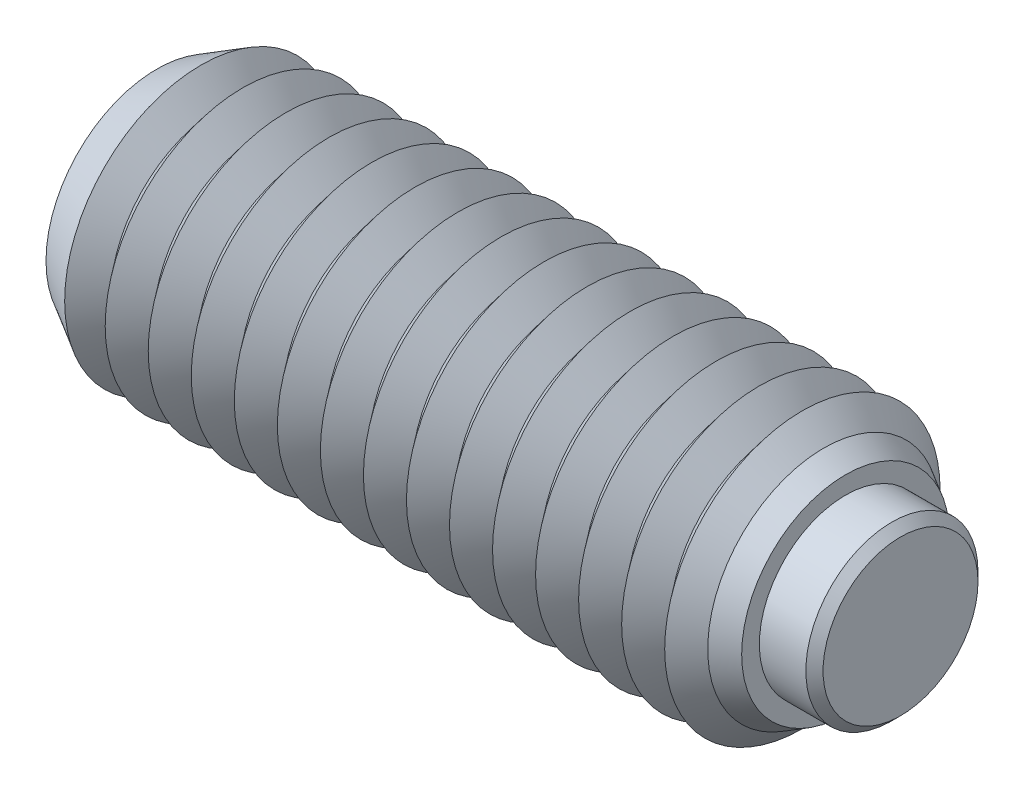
ISO-10303-21;
HEADER;
FILE_DESCRIPTION(('STEP AP214'),'2;1');
FILE_NAME('part.step','',(''),(''),'','','');
FILE_SCHEMA(('AUTOMOTIVE_DESIGN { 1 0 10303 214 1 1 1 1 }'));
ENDSEC;
DATA;
#1=APPLICATION_CONTEXT('core data for automotive mechanical design processes');
#2=APPLICATION_PROTOCOL_DEFINITION('international standard','automotive_design',2000,#1);
#3=PRODUCT_CONTEXT('',#1,'mechanical');
#4=PRODUCT('Part','Part','',(#3));
#5=PRODUCT_RELATED_PRODUCT_CATEGORY('part','',(#4));
#6=PRODUCT_DEFINITION_FORMATION('','',#4);
#7=PRODUCT_DEFINITION_CONTEXT('part definition',#1,'design');
#8=PRODUCT_DEFINITION('design','',#6,#7);
#9=PRODUCT_DEFINITION_SHAPE('','',#8);
#10=(LENGTH_UNIT() NAMED_UNIT(*) SI_UNIT(.MILLI.,.METRE.));
#11=(NAMED_UNIT(*) PLANE_ANGLE_UNIT() SI_UNIT($,.RADIAN.));
#12=(NAMED_UNIT(*) SI_UNIT($,.STERADIAN.) SOLID_ANGLE_UNIT());
#13=UNCERTAINTY_MEASURE_WITH_UNIT(LENGTH_MEASURE(1.E-05),#10,'distance_accuracy_value','');
#14=(GEOMETRIC_REPRESENTATION_CONTEXT(3) GLOBAL_UNCERTAINTY_ASSIGNED_CONTEXT((#13)) GLOBAL_UNIT_ASSIGNED_CONTEXT((#10,
#11,#12)) REPRESENTATION_CONTEXT('',''));
#15=CARTESIAN_POINT('',(0.,0.,0.));
#16=DIRECTION('',(0.,0.,1.));
#17=DIRECTION('',(1.,0.,0.));
#18=AXIS2_PLACEMENT_3D('',#15,#16,#17);
#19=CARTESIAN_POINT('',(2.225,0.,0.));
#20=DIRECTION('',(-1.,0.,0.));
#21=DIRECTION('',(0.,0.,1.));
#22=AXIS2_PLACEMENT_3D('',#19,#20,#21);
#23=CYLINDRICAL_SURFACE('',#22,2.5);
#24=CARTESIAN_POINT('',(1.975,0.,0.));
#25=DIRECTION('',(1.,0.,0.));
#26=DIRECTION('',(0.,0.,-1.));
#27=AXIS2_PLACEMENT_3D('',#24,#25,#26);
#28=CIRCLE('',#27,2.5);
#29=CARTESIAN_POINT('',(1.975,0.,-2.49999999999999));
#30=VERTEX_POINT('',#29);
#31=EDGE_CURVE('P0_E10',#30,#30,#28,.F.);
#32=ORIENTED_EDGE('',*,*,#31,.T.);
#33=EDGE_LOOP('',(#32));
#34=FACE_BOUND('',#33,.T.);
#35=CARTESIAN_POINT('',(-0.975,0.,0.));
#36=DIRECTION('',(1.,0.,0.));
#37=DIRECTION('',(0.,0.,-1.));
#38=AXIS2_PLACEMENT_3D('',#35,#36,#37);
#39=CIRCLE('',#38,2.5);
#40=CARTESIAN_POINT('',(-0.975,0.,-2.49999999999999));
#41=VERTEX_POINT('',#40);
#42=EDGE_CURVE('P0_E25',#41,#41,#39,.T.);
#43=ORIENTED_EDGE('',*,*,#42,.T.);
#44=EDGE_LOOP('',(#43));
#45=FACE_BOUND('',#44,.T.);
#46=ADVANCED_FACE('P0_F14',(#34,#45),#23,.T.);
#47=CARTESIAN_POINT('',(2.225,0.,0.));
#48=DIRECTION('',(1.,0.,0.));
#49=DIRECTION('',(0.,0.,-1.));
#50=AXIS2_PLACEMENT_3D('',#47,#48,#49);
#51=PLANE('',#50);
#52=CARTESIAN_POINT('',(2.225,0.,0.));
#53=DIRECTION('',(1.,0.,0.));
#54=DIRECTION('',(0.,0.,-1.));
#55=AXIS2_PLACEMENT_3D('',#52,#53,#54);
#56=CIRCLE('',#55,2.25);
#57=CARTESIAN_POINT('',(2.225,0.,-2.24999999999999));
#58=VERTEX_POINT('',#57);
#59=EDGE_CURVE('P0_E21',#58,#58,#56,.T.);
#60=ORIENTED_EDGE('',*,*,#59,.T.);
#61=EDGE_LOOP('',(#60));
#62=FACE_BOUND('',#61,.T.);
#63=ADVANCED_FACE('P0_F35',(#62),#51,.T.);
#64=CARTESIAN_POINT('',(-0.975,0.,0.));
#65=DIRECTION('',(1.,0.,0.));
#66=DIRECTION('',(0.,0.,-1.));
#67=AXIS2_PLACEMENT_3D('',#64,#65,#66);
#68=PLANE('',#67);
#69=ORIENTED_EDGE('',*,*,#42,.F.);
#70=EDGE_LOOP('',(#69));
#71=FACE_BOUND('',#70,.T.);
#72=ADVANCED_FACE('P0_F33',(#71),#68,.F.);
#73=CARTESIAN_POINT('',(2.225,0.,0.));
#74=DIRECTION('',(-1.,0.,0.));
#75=DIRECTION('',(0.,0.,1.));
#76=AXIS2_PLACEMENT_3D('',#73,#74,#75);
#77=CONICAL_SURFACE('',#76,2.25,0.785398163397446);
#78=ORIENTED_EDGE('',*,*,#31,.F.);
#79=EDGE_LOOP('',(#78));
#80=FACE_BOUND('',#79,.T.);
#81=ORIENTED_EDGE('',*,*,#59,.F.);
#82=EDGE_LOOP('',(#81));
#83=FACE_BOUND('',#82,.T.);
#84=ADVANCED_FACE('P0_F16',(#80,#83),#77,.T.);
#85=CLOSED_SHELL('',(#46,#63,#72,#84));
#86=MANIFOLD_SOLID_BREP('P0_B1',#85);
#87=CARTESIAN_POINT('',(-18.125,0.,0.));
#88=DIRECTION('',(-1.,0.,0.));
#89=DIRECTION('',(0.,0.,1.));
#90=AXIS2_PLACEMENT_3D('',#87,#88,#89);
#91=CONICAL_SURFACE('',#90,4.,0.895664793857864);
#92=CARTESIAN_POINT('',(-17.5,0.,0.));
#93=DIRECTION('',(1.,0.,0.));
#94=DIRECTION('',(0.,0.,-1.));
#95=AXIS2_PLACEMENT_3D('',#92,#93,#94);
#96=CIRCLE('',#95,3.2193752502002);
#97=CARTESIAN_POINT('',(-17.5,0.,-3.2193752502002));
#98=VERTEX_POINT('',#97);
#99=EDGE_CURVE('P1_E853',#98,#98,#96,.T.);
#100=ORIENTED_EDGE('',*,*,#99,.F.);
#101=EDGE_LOOP('',(#100));
#102=FACE_BOUND('',#101,.T.);
#103=CARTESIAN_POINT('',(-18.092729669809,0.,0.));
#104=DIRECTION('',(1.,0.,0.));
#105=DIRECTION('',(0.,0.,-1.));
#106=AXIS2_PLACEMENT_3D('',#103,#104,#105);
#107=CIRCLE('',#106,3.95969437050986);
#108=CARTESIAN_POINT('',(-18.092729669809,0.,-3.95969437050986));
#109=VERTEX_POINT('',#108);
#110=EDGE_CURVE('P1_E856',#109,#109,#107,.F.);
#111=ORIENTED_EDGE('',*,*,#110,.F.);
#112=EDGE_LOOP('',(#111));
#113=FACE_BOUND('',#112,.T.);
#114=ADVANCED_FACE('P1_F15',(#102,#113),#91,.T.);
#115=CARTESIAN_POINT('',(-1.25,0.,0.));
#116=DIRECTION('',(1.,0.,0.));
#117=DIRECTION('',(0.,0.,-1.));
#118=AXIS2_PLACEMENT_3D('',#115,#116,#117);
#119=CONICAL_SURFACE('',#118,3.2193752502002,0.895664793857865);
#120=CARTESIAN_POINT('',(-0.625000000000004,0.,0.));
#121=DIRECTION('',(1.,0.,0.));
#122=DIRECTION('',(0.,0.,-1.));
#123=AXIS2_PLACEMENT_3D('',#120,#121,#122);
#124=CIRCLE('',#123,4.);
#125=CARTESIAN_POINT('',(-0.625000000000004,0.,-4.));
#126=VERTEX_POINT('',#125);
#127=EDGE_CURVE('P1_E771',#126,#126,#124,.T.);
#128=ORIENTED_EDGE('',*,*,#127,.F.);
#129=EDGE_LOOP('',(#128));
#130=FACE_BOUND('',#129,.T.);
#131=CARTESIAN_POINT('',(-1.25,0.,0.));
#132=DIRECTION('',(1.,0.,0.));
#133=DIRECTION('',(0.,0.,-1.));
#134=AXIS2_PLACEMENT_3D('',#131,#132,#133);
#135=CIRCLE('',#134,3.2193752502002);
#136=CARTESIAN_POINT('',(-1.25,0.,-3.2193752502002));
#137=VERTEX_POINT('',#136);
#138=EDGE_CURVE('P1_E772',#137,#137,#135,.T.);
#139=ORIENTED_EDGE('',*,*,#138,.T.);
#140=EDGE_LOOP('',(#139));
#141=FACE_BOUND('',#140,.T.);
#142=ADVANCED_FACE('P1_F222',(#130,#141),#119,.T.);
#143=CARTESIAN_POINT('',(-1.875,0.,0.));
#144=DIRECTION('',(-1.,0.,0.));
#145=DIRECTION('',(0.,0.,1.));
#146=AXIS2_PLACEMENT_3D('',#143,#144,#145);
#147=CONICAL_SURFACE('',#146,4.,0.895664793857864);
#148=ORIENTED_EDGE('',*,*,#138,.F.);
#149=EDGE_LOOP('',(#148));
#150=FACE_BOUND('',#149,.T.);
#151=CARTESIAN_POINT('',(-1.875,0.,0.));
#152=DIRECTION('',(1.,0.,0.));
#153=DIRECTION('',(0.,0.,-1.));
#154=AXIS2_PLACEMENT_3D('',#151,#152,#153);
#155=CIRCLE('',#154,4.);
#156=CARTESIAN_POINT('',(-1.875,0.,-4.));
#157=VERTEX_POINT('',#156);
#158=EDGE_CURVE('P1_E776',#157,#157,#155,.T.);
#159=ORIENTED_EDGE('',*,*,#158,.T.);
#160=EDGE_LOOP('',(#159));
#161=FACE_BOUND('',#160,.T.);
#162=ADVANCED_FACE('P1_F227',(#150,#161),#147,.T.);
#163=CARTESIAN_POINT('',(-0.975,0.,0.));
#164=DIRECTION('',(1.,0.,0.));
#165=DIRECTION('',(0.,1.,0.));
#166=AXIS2_PLACEMENT_3D('',#163,#164,#165);
#167=PLANE('',#166);
#168=CARTESIAN_POINT('',(-0.975,0.,0.));
#169=DIRECTION('',(1.,0.,0.));
#170=DIRECTION('',(0.,1.,0.));
#171=AXIS2_PLACEMENT_3D('',#168,#169,#170);
#172=CIRCLE('',#171,2.5);
#173=CARTESIAN_POINT('',(-0.975,2.5,0.));
#174=VERTEX_POINT('',#173);
#175=EDGE_CURVE('P1_E406',#174,#174,#172,.T.);
#176=ORIENTED_EDGE('',*,*,#175,.T.);
#177=EDGE_LOOP('',(#176));
#178=FACE_BOUND('',#177,.T.);
#179=ADVANCED_FACE('P1_F333',(#178),#167,.T.);
#180=CARTESIAN_POINT('',(-0.975,0.,0.));
#181=DIRECTION('',(1.,0.,0.));
#182=DIRECTION('',(0.,1.,0.));
#183=AXIS2_PLACEMENT_3D('',#180,#181,#182);
#184=CYLINDRICAL_SURFACE('',#183,2.5);
#185=ORIENTED_EDGE('',*,*,#175,.F.);
#186=EDGE_LOOP('',(#185));
#187=FACE_BOUND('',#186,.T.);
#188=CARTESIAN_POINT('',(0.625,0.,0.));
#189=DIRECTION('',(1.,0.,0.));
#190=DIRECTION('',(0.,1.,0.));
#191=AXIS2_PLACEMENT_3D('',#188,#189,#190);
#192=CIRCLE('',#191,2.5);
#193=CARTESIAN_POINT('',(0.625,2.5,0.));
#194=VERTEX_POINT('',#193);
#195=EDGE_CURVE('P1_E409',#194,#194,#192,.T.);
#196=ORIENTED_EDGE('',*,*,#195,.T.);
#197=EDGE_LOOP('',(#196));
#198=FACE_BOUND('',#197,.T.);
#199=ADVANCED_FACE('P1_F209',(#187,#198),#184,.F.);
#200=CARTESIAN_POINT('',(0.625,3.01415608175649,0.));
#201=DIRECTION('',(1.,0.,0.));
#202=DIRECTION('',(0.,1.,0.));
#203=AXIS2_PLACEMENT_3D('',#200,#201,#202);
#204=PLANE('',#203);
#205=ORIENTED_EDGE('',*,*,#195,.F.);
#206=EDGE_LOOP('',(#205));
#207=FACE_BOUND('',#206,.T.);
#208=CARTESIAN_POINT('',(0.625,0.,0.));
#209=DIRECTION('',(1.,0.,0.));
#210=DIRECTION('',(0.,1.,0.));
#211=AXIS2_PLACEMENT_3D('',#208,#209,#210);
#212=CIRCLE('',#211,3.01415608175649);
#213=CARTESIAN_POINT('',(0.625,3.01415608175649,0.));
#214=VERTEX_POINT('',#213);
#215=EDGE_CURVE('P1_E121',#214,#214,#212,.T.);
#216=ORIENTED_EDGE('',*,*,#215,.T.);
#217=EDGE_LOOP('',(#216));
#218=FACE_BOUND('',#217,.T.);
#219=ADVANCED_FACE('P1_F206',(#207,#218),#204,.T.);
#220=CARTESIAN_POINT('',(0.625,0.,0.));
#221=DIRECTION('',(-1.,0.,0.));
#222=DIRECTION('',(0.,-1.,0.));
#223=AXIS2_PLACEMENT_3D('',#220,#221,#222);
#224=CONICAL_SURFACE('',#223,3.01415608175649,0.523598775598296);
#225=CARTESIAN_POINT('',(0.,0.,0.));
#226=DIRECTION('',(1.,0.,0.));
#227=DIRECTION('',(0.,0.,-1.));
#228=AXIS2_PLACEMENT_3D('',#225,#226,#227);
#229=CIRCLE('',#228,3.375);
#230=CARTESIAN_POINT('',(0.,0.,-3.375));
#231=VERTEX_POINT('',#230);
#232=EDGE_CURVE('P1_E397',#231,#231,#229,.T.);
#233=ORIENTED_EDGE('',*,*,#232,.T.);
#234=EDGE_LOOP('',(#233));
#235=FACE_BOUND('',#234,.T.);
#236=ORIENTED_EDGE('',*,*,#215,.F.);
#237=EDGE_LOOP('',(#236));
#238=FACE_BOUND('',#237,.T.);
#239=ADVANCED_FACE('P1_F203',(#235,#238),#224,.T.);
#240=CARTESIAN_POINT('',(0.,0.,0.));
#241=DIRECTION('',(-1.,0.,0.));
#242=DIRECTION('',(0.,0.,1.));
#243=AXIS2_PLACEMENT_3D('',#240,#241,#242);
#244=CONICAL_SURFACE('',#243,3.375,0.785398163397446);
#245=ORIENTED_EDGE('',*,*,#127,.T.);
#246=EDGE_LOOP('',(#245));
#247=FACE_BOUND('',#246,.T.);
#248=ORIENTED_EDGE('',*,*,#232,.F.);
#249=EDGE_LOOP('',(#248));
#250=FACE_BOUND('',#249,.T.);
#251=ADVANCED_FACE('P1_F17',(#247,#250),#244,.T.);
#252=CARTESIAN_POINT('',(-2.5,0.,0.));
#253=DIRECTION('',(1.,0.,0.));
#254=DIRECTION('',(0.,0.,-1.));
#255=AXIS2_PLACEMENT_3D('',#252,#253,#254);
#256=CONICAL_SURFACE('',#255,3.2193752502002,0.895664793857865);
#257=ORIENTED_EDGE('',*,*,#158,.F.);
#258=EDGE_LOOP('',(#257));
#259=FACE_BOUND('',#258,.T.);
#260=CARTESIAN_POINT('',(-2.5,0.,0.));
#261=DIRECTION('',(1.,0.,0.));
#262=DIRECTION('',(0.,0.,-1.));
#263=AXIS2_PLACEMENT_3D('',#260,#261,#262);
#264=CIRCLE('',#263,3.2193752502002);
#265=CARTESIAN_POINT('',(-2.5,0.,-3.2193752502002));
#266=VERTEX_POINT('',#265);
#267=EDGE_CURVE('P1_E781',#266,#266,#264,.T.);
#268=ORIENTED_EDGE('',*,*,#267,.T.);
#269=EDGE_LOOP('',(#268));
#270=FACE_BOUND('',#269,.T.);
#271=ADVANCED_FACE('P1_F327',(#259,#270),#256,.T.);
#272=CARTESIAN_POINT('',(-3.125,0.,0.));
#273=DIRECTION('',(-1.,0.,0.));
#274=DIRECTION('',(0.,0.,1.));
#275=AXIS2_PLACEMENT_3D('',#272,#273,#274);
#276=CONICAL_SURFACE('',#275,4.,0.895664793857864);
#277=ORIENTED_EDGE('',*,*,#267,.F.);
#278=EDGE_LOOP('',(#277));
#279=FACE_BOUND('',#278,.T.);
#280=CARTESIAN_POINT('',(-3.125,0.,0.));
#281=DIRECTION('',(1.,0.,0.));
#282=DIRECTION('',(0.,0.,-1.));
#283=AXIS2_PLACEMENT_3D('',#280,#281,#282);
#284=CIRCLE('',#283,4.);
#285=CARTESIAN_POINT('',(-3.125,0.,-4.));
#286=VERTEX_POINT('',#285);
#287=EDGE_CURVE('P1_E784',#286,#286,#284,.T.);
#288=ORIENTED_EDGE('',*,*,#287,.T.);
#289=EDGE_LOOP('',(#288));
#290=FACE_BOUND('',#289,.T.);
#291=ADVANCED_FACE('P1_F323',(#279,#290),#276,.T.);
#292=CARTESIAN_POINT('',(-3.75,0.,0.));
#293=DIRECTION('',(1.,0.,0.));
#294=DIRECTION('',(0.,0.,-1.));
#295=AXIS2_PLACEMENT_3D('',#292,#293,#294);
#296=CONICAL_SURFACE('',#295,3.2193752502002,0.895664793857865);
#297=ORIENTED_EDGE('',*,*,#287,.F.);
#298=EDGE_LOOP('',(#297));
#299=FACE_BOUND('',#298,.T.);
#300=CARTESIAN_POINT('',(-3.75,0.,0.));
#301=DIRECTION('',(1.,0.,0.));
#302=DIRECTION('',(0.,0.,-1.));
#303=AXIS2_PLACEMENT_3D('',#300,#301,#302);
#304=CIRCLE('',#303,3.2193752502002);
#305=CARTESIAN_POINT('',(-3.75,0.,-3.2193752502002));
#306=VERTEX_POINT('',#305);
#307=EDGE_CURVE('P1_E787',#306,#306,#304,.T.);
#308=ORIENTED_EDGE('',*,*,#307,.T.);
#309=EDGE_LOOP('',(#308));
#310=FACE_BOUND('',#309,.T.);
#311=ADVANCED_FACE('P1_F319',(#299,#310),#296,.T.);
#312=CARTESIAN_POINT('',(-4.375,0.,0.));
#313=DIRECTION('',(-1.,0.,0.));
#314=DIRECTION('',(0.,0.,1.));
#315=AXIS2_PLACEMENT_3D('',#312,#313,#314);
#316=CONICAL_SURFACE('',#315,4.,0.895664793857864);
#317=ORIENTED_EDGE('',*,*,#307,.F.);
#318=EDGE_LOOP('',(#317));
#319=FACE_BOUND('',#318,.T.);
#320=CARTESIAN_POINT('',(-4.375,0.,0.));
#321=DIRECTION('',(1.,0.,0.));
#322=DIRECTION('',(0.,0.,-1.));
#323=AXIS2_PLACEMENT_3D('',#320,#321,#322);
#324=CIRCLE('',#323,4.);
#325=CARTESIAN_POINT('',(-4.375,0.,-4.));
#326=VERTEX_POINT('',#325);
#327=EDGE_CURVE('P1_E790',#326,#326,#324,.T.);
#328=ORIENTED_EDGE('',*,*,#327,.T.);
#329=EDGE_LOOP('',(#328));
#330=FACE_BOUND('',#329,.T.);
#331=ADVANCED_FACE('P1_F315',(#319,#330),#316,.T.);
#332=CARTESIAN_POINT('',(-5.,0.,0.));
#333=DIRECTION('',(1.,0.,0.));
#334=DIRECTION('',(0.,0.,-1.));
#335=AXIS2_PLACEMENT_3D('',#332,#333,#334);
#336=CONICAL_SURFACE('',#335,3.2193752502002,0.895664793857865);
#337=ORIENTED_EDGE('',*,*,#327,.F.);
#338=EDGE_LOOP('',(#337));
#339=FACE_BOUND('',#338,.T.);
#340=CARTESIAN_POINT('',(-5.,0.,0.));
#341=DIRECTION('',(1.,0.,0.));
#342=DIRECTION('',(0.,0.,-1.));
#343=AXIS2_PLACEMENT_3D('',#340,#341,#342);
#344=CIRCLE('',#343,3.2193752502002);
#345=CARTESIAN_POINT('',(-5.,0.,-3.2193752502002));
#346=VERTEX_POINT('',#345);
#347=EDGE_CURVE('P1_E793',#346,#346,#344,.T.);
#348=ORIENTED_EDGE('',*,*,#347,.T.);
#349=EDGE_LOOP('',(#348));
#350=FACE_BOUND('',#349,.T.);
#351=ADVANCED_FACE('P1_F311',(#339,#350),#336,.T.);
#352=CARTESIAN_POINT('',(-5.625,0.,0.));
#353=DIRECTION('',(-1.,0.,0.));
#354=DIRECTION('',(0.,0.,1.));
#355=AXIS2_PLACEMENT_3D('',#352,#353,#354);
#356=CONICAL_SURFACE('',#355,4.,0.895664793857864);
#357=ORIENTED_EDGE('',*,*,#347,.F.);
#358=EDGE_LOOP('',(#357));
#359=FACE_BOUND('',#358,.T.);
#360=CARTESIAN_POINT('',(-5.625,0.,0.));
#361=DIRECTION('',(1.,0.,0.));
#362=DIRECTION('',(0.,0.,-1.));
#363=AXIS2_PLACEMENT_3D('',#360,#361,#362);
#364=CIRCLE('',#363,4.);
#365=CARTESIAN_POINT('',(-5.625,0.,-4.));
#366=VERTEX_POINT('',#365);
#367=EDGE_CURVE('P1_E796',#366,#366,#364,.T.);
#368=ORIENTED_EDGE('',*,*,#367,.T.);
#369=EDGE_LOOP('',(#368));
#370=FACE_BOUND('',#369,.T.);
#371=ADVANCED_FACE('P1_F307',(#359,#370),#356,.T.);
#372=CARTESIAN_POINT('',(-6.25,0.,0.));
#373=DIRECTION('',(1.,0.,0.));
#374=DIRECTION('',(0.,0.,-1.));
#375=AXIS2_PLACEMENT_3D('',#372,#373,#374);
#376=CONICAL_SURFACE('',#375,3.2193752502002,0.895664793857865);
#377=ORIENTED_EDGE('',*,*,#367,.F.);
#378=EDGE_LOOP('',(#377));
#379=FACE_BOUND('',#378,.T.);
#380=CARTESIAN_POINT('',(-6.25,0.,0.));
#381=DIRECTION('',(1.,0.,0.));
#382=DIRECTION('',(0.,0.,-1.));
#383=AXIS2_PLACEMENT_3D('',#380,#381,#382);
#384=CIRCLE('',#383,3.2193752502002);
#385=CARTESIAN_POINT('',(-6.25,0.,-3.2193752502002));
#386=VERTEX_POINT('',#385);
#387=EDGE_CURVE('P1_E799',#386,#386,#384,.T.);
#388=ORIENTED_EDGE('',*,*,#387,.T.);
#389=EDGE_LOOP('',(#388));
#390=FACE_BOUND('',#389,.T.);
#391=ADVANCED_FACE('P1_F303',(#379,#390),#376,.T.);
#392=CARTESIAN_POINT('',(-6.875,0.,0.));
#393=DIRECTION('',(-1.,0.,0.));
#394=DIRECTION('',(0.,0.,1.));
#395=AXIS2_PLACEMENT_3D('',#392,#393,#394);
#396=CONICAL_SURFACE('',#395,4.,0.895664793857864);
#397=ORIENTED_EDGE('',*,*,#387,.F.);
#398=EDGE_LOOP('',(#397));
#399=FACE_BOUND('',#398,.T.);
#400=CARTESIAN_POINT('',(-6.875,0.,0.));
#401=DIRECTION('',(1.,0.,0.));
#402=DIRECTION('',(0.,0.,-1.));
#403=AXIS2_PLACEMENT_3D('',#400,#401,#402);
#404=CIRCLE('',#403,4.);
#405=CARTESIAN_POINT('',(-6.875,0.,-4.));
#406=VERTEX_POINT('',#405);
#407=EDGE_CURVE('P1_E802',#406,#406,#404,.T.);
#408=ORIENTED_EDGE('',*,*,#407,.T.);
#409=EDGE_LOOP('',(#408));
#410=FACE_BOUND('',#409,.T.);
#411=ADVANCED_FACE('P1_F299',(#399,#410),#396,.T.);
#412=CARTESIAN_POINT('',(-7.5,0.,0.));
#413=DIRECTION('',(1.,0.,0.));
#414=DIRECTION('',(0.,0.,-1.));
#415=AXIS2_PLACEMENT_3D('',#412,#413,#414);
#416=CONICAL_SURFACE('',#415,3.2193752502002,0.895664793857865);
#417=ORIENTED_EDGE('',*,*,#407,.F.);
#418=EDGE_LOOP('',(#417));
#419=FACE_BOUND('',#418,.T.);
#420=CARTESIAN_POINT('',(-7.5,0.,0.));
#421=DIRECTION('',(1.,0.,0.));
#422=DIRECTION('',(0.,0.,-1.));
#423=AXIS2_PLACEMENT_3D('',#420,#421,#422);
#424=CIRCLE('',#423,3.2193752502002);
#425=CARTESIAN_POINT('',(-7.5,0.,-3.2193752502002));
#426=VERTEX_POINT('',#425);
#427=EDGE_CURVE('P1_E805',#426,#426,#424,.T.);
#428=ORIENTED_EDGE('',*,*,#427,.T.);
#429=EDGE_LOOP('',(#428));
#430=FACE_BOUND('',#429,.T.);
#431=ADVANCED_FACE('P1_F295',(#419,#430),#416,.T.);
#432=CARTESIAN_POINT('',(-8.125,0.,0.));
#433=DIRECTION('',(-1.,0.,0.));
#434=DIRECTION('',(0.,0.,1.));
#435=AXIS2_PLACEMENT_3D('',#432,#433,#434);
#436=CONICAL_SURFACE('',#435,4.,0.895664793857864);
#437=ORIENTED_EDGE('',*,*,#427,.F.);
#438=EDGE_LOOP('',(#437));
#439=FACE_BOUND('',#438,.T.);
#440=CARTESIAN_POINT('',(-8.125,0.,0.));
#441=DIRECTION('',(1.,0.,0.));
#442=DIRECTION('',(0.,0.,-1.));
#443=AXIS2_PLACEMENT_3D('',#440,#441,#442);
#444=CIRCLE('',#443,4.);
#445=CARTESIAN_POINT('',(-8.125,0.,-4.));
#446=VERTEX_POINT('',#445);
#447=EDGE_CURVE('P1_E808',#446,#446,#444,.T.);
#448=ORIENTED_EDGE('',*,*,#447,.T.);
#449=EDGE_LOOP('',(#448));
#450=FACE_BOUND('',#449,.T.);
#451=ADVANCED_FACE('P1_F291',(#439,#450),#436,.T.);
#452=CARTESIAN_POINT('',(-8.75,0.,0.));
#453=DIRECTION('',(1.,0.,0.));
#454=DIRECTION('',(0.,0.,-1.));
#455=AXIS2_PLACEMENT_3D('',#452,#453,#454);
#456=CONICAL_SURFACE('',#455,3.2193752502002,0.895664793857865);
#457=ORIENTED_EDGE('',*,*,#447,.F.);
#458=EDGE_LOOP('',(#457));
#459=FACE_BOUND('',#458,.T.);
#460=CARTESIAN_POINT('',(-8.75,0.,0.));
#461=DIRECTION('',(1.,0.,0.));
#462=DIRECTION('',(0.,0.,-1.));
#463=AXIS2_PLACEMENT_3D('',#460,#461,#462);
#464=CIRCLE('',#463,3.2193752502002);
#465=CARTESIAN_POINT('',(-8.75,0.,-3.2193752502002));
#466=VERTEX_POINT('',#465);
#467=EDGE_CURVE('P1_E811',#466,#466,#464,.T.);
#468=ORIENTED_EDGE('',*,*,#467,.T.);
#469=EDGE_LOOP('',(#468));
#470=FACE_BOUND('',#469,.T.);
#471=ADVANCED_FACE('P1_F287',(#459,#470),#456,.T.);
#472=CARTESIAN_POINT('',(-9.375,0.,0.));
#473=DIRECTION('',(-1.,0.,0.));
#474=DIRECTION('',(0.,0.,1.));
#475=AXIS2_PLACEMENT_3D('',#472,#473,#474);
#476=CONICAL_SURFACE('',#475,4.,0.895664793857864);
#477=ORIENTED_EDGE('',*,*,#467,.F.);
#478=EDGE_LOOP('',(#477));
#479=FACE_BOUND('',#478,.T.);
#480=CARTESIAN_POINT('',(-9.37500000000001,0.,0.));
#481=DIRECTION('',(1.,0.,0.));
#482=DIRECTION('',(0.,0.,-1.));
#483=AXIS2_PLACEMENT_3D('',#480,#481,#482);
#484=CIRCLE('',#483,4.);
#485=CARTESIAN_POINT('',(-9.37500000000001,0.,-4.));
#486=VERTEX_POINT('',#485);
#487=EDGE_CURVE('P1_E814',#486,#486,#484,.T.);
#488=ORIENTED_EDGE('',*,*,#487,.T.);
#489=EDGE_LOOP('',(#488));
#490=FACE_BOUND('',#489,.T.);
#491=ADVANCED_FACE('P1_F283',(#479,#490),#476,.T.);
#492=CARTESIAN_POINT('',(-10.,0.,0.));
#493=DIRECTION('',(1.,0.,0.));
#494=DIRECTION('',(0.,0.,-1.));
#495=AXIS2_PLACEMENT_3D('',#492,#493,#494);
#496=CONICAL_SURFACE('',#495,3.2193752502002,0.895664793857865);
#497=ORIENTED_EDGE('',*,*,#487,.F.);
#498=EDGE_LOOP('',(#497));
#499=FACE_BOUND('',#498,.T.);
#500=CARTESIAN_POINT('',(-10.,0.,0.));
#501=DIRECTION('',(1.,0.,0.));
#502=DIRECTION('',(0.,0.,-1.));
#503=AXIS2_PLACEMENT_3D('',#500,#501,#502);
#504=CIRCLE('',#503,3.2193752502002);
#505=CARTESIAN_POINT('',(-10.,0.,-3.2193752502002));
#506=VERTEX_POINT('',#505);
#507=EDGE_CURVE('P1_E817',#506,#506,#504,.T.);
#508=ORIENTED_EDGE('',*,*,#507,.T.);
#509=EDGE_LOOP('',(#508));
#510=FACE_BOUND('',#509,.T.);
#511=ADVANCED_FACE('P1_F279',(#499,#510),#496,.T.);
#512=CARTESIAN_POINT('',(-10.625,0.,0.));
#513=DIRECTION('',(-1.,0.,0.));
#514=DIRECTION('',(0.,0.,1.));
#515=AXIS2_PLACEMENT_3D('',#512,#513,#514);
#516=CONICAL_SURFACE('',#515,4.,0.895664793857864);
#517=ORIENTED_EDGE('',*,*,#507,.F.);
#518=EDGE_LOOP('',(#517));
#519=FACE_BOUND('',#518,.T.);
#520=CARTESIAN_POINT('',(-10.625,0.,0.));
#521=DIRECTION('',(1.,0.,0.));
#522=DIRECTION('',(0.,0.,-1.));
#523=AXIS2_PLACEMENT_3D('',#520,#521,#522);
#524=CIRCLE('',#523,4.);
#525=CARTESIAN_POINT('',(-10.625,0.,-4.));
#526=VERTEX_POINT('',#525);
#527=EDGE_CURVE('P1_E820',#526,#526,#524,.T.);
#528=ORIENTED_EDGE('',*,*,#527,.T.);
#529=EDGE_LOOP('',(#528));
#530=FACE_BOUND('',#529,.T.);
#531=ADVANCED_FACE('P1_F275',(#519,#530),#516,.T.);
#532=CARTESIAN_POINT('',(-11.25,0.,0.));
#533=DIRECTION('',(1.,0.,0.));
#534=DIRECTION('',(0.,0.,-1.));
#535=AXIS2_PLACEMENT_3D('',#532,#533,#534);
#536=CONICAL_SURFACE('',#535,3.2193752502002,0.895664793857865);
#537=ORIENTED_EDGE('',*,*,#527,.F.);
#538=EDGE_LOOP('',(#537));
#539=FACE_BOUND('',#538,.T.);
#540=CARTESIAN_POINT('',(-11.25,0.,0.));
#541=DIRECTION('',(1.,0.,0.));
#542=DIRECTION('',(0.,0.,-1.));
#543=AXIS2_PLACEMENT_3D('',#540,#541,#542);
#544=CIRCLE('',#543,3.2193752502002);
#545=CARTESIAN_POINT('',(-11.25,0.,-3.2193752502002));
#546=VERTEX_POINT('',#545);
#547=EDGE_CURVE('P1_E823',#546,#546,#544,.T.);
#548=ORIENTED_EDGE('',*,*,#547,.T.);
#549=EDGE_LOOP('',(#548));
#550=FACE_BOUND('',#549,.T.);
#551=ADVANCED_FACE('P1_F271',(#539,#550),#536,.T.);
#552=CARTESIAN_POINT('',(-11.875,0.,0.));
#553=DIRECTION('',(-1.,0.,0.));
#554=DIRECTION('',(0.,0.,1.));
#555=AXIS2_PLACEMENT_3D('',#552,#553,#554);
#556=CONICAL_SURFACE('',#555,4.,0.895664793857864);
#557=ORIENTED_EDGE('',*,*,#547,.F.);
#558=EDGE_LOOP('',(#557));
#559=FACE_BOUND('',#558,.T.);
#560=CARTESIAN_POINT('',(-11.875,0.,0.));
#561=DIRECTION('',(1.,0.,0.));
#562=DIRECTION('',(0.,0.,-1.));
#563=AXIS2_PLACEMENT_3D('',#560,#561,#562);
#564=CIRCLE('',#563,4.);
#565=CARTESIAN_POINT('',(-11.875,0.,-4.));
#566=VERTEX_POINT('',#565);
#567=EDGE_CURVE('P1_E826',#566,#566,#564,.T.);
#568=ORIENTED_EDGE('',*,*,#567,.T.);
#569=EDGE_LOOP('',(#568));
#570=FACE_BOUND('',#569,.T.);
#571=ADVANCED_FACE('P1_F267',(#559,#570),#556,.T.);
#572=CARTESIAN_POINT('',(-12.5,0.,0.));
#573=DIRECTION('',(1.,0.,0.));
#574=DIRECTION('',(0.,0.,-1.));
#575=AXIS2_PLACEMENT_3D('',#572,#573,#574);
#576=CONICAL_SURFACE('',#575,3.2193752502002,0.895664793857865);
#577=ORIENTED_EDGE('',*,*,#567,.F.);
#578=EDGE_LOOP('',(#577));
#579=FACE_BOUND('',#578,.T.);
#580=CARTESIAN_POINT('',(-12.5,0.,0.));
#581=DIRECTION('',(1.,0.,0.));
#582=DIRECTION('',(0.,0.,-1.));
#583=AXIS2_PLACEMENT_3D('',#580,#581,#582);
#584=CIRCLE('',#583,3.2193752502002);
#585=CARTESIAN_POINT('',(-12.5,0.,-3.2193752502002));
#586=VERTEX_POINT('',#585);
#587=EDGE_CURVE('P1_E829',#586,#586,#584,.T.);
#588=ORIENTED_EDGE('',*,*,#587,.T.);
#589=EDGE_LOOP('',(#588));
#590=FACE_BOUND('',#589,.T.);
#591=ADVANCED_FACE('P1_F263',(#579,#590),#576,.T.);
#592=CARTESIAN_POINT('',(-13.125,0.,0.));
#593=DIRECTION('',(-1.,0.,0.));
#594=DIRECTION('',(0.,0.,1.));
#595=AXIS2_PLACEMENT_3D('',#592,#593,#594);
#596=CONICAL_SURFACE('',#595,4.,0.895664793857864);
#597=ORIENTED_EDGE('',*,*,#587,.F.);
#598=EDGE_LOOP('',(#597));
#599=FACE_BOUND('',#598,.T.);
#600=CARTESIAN_POINT('',(-13.125,0.,0.));
#601=DIRECTION('',(1.,0.,0.));
#602=DIRECTION('',(0.,0.,-1.));
#603=AXIS2_PLACEMENT_3D('',#600,#601,#602);
#604=CIRCLE('',#603,4.);
#605=CARTESIAN_POINT('',(-13.125,0.,-4.));
#606=VERTEX_POINT('',#605);
#607=EDGE_CURVE('P1_E832',#606,#606,#604,.T.);
#608=ORIENTED_EDGE('',*,*,#607,.T.);
#609=EDGE_LOOP('',(#608));
#610=FACE_BOUND('',#609,.T.);
#611=ADVANCED_FACE('P1_F259',(#599,#610),#596,.T.);
#612=CARTESIAN_POINT('',(-13.75,0.,0.));
#613=DIRECTION('',(1.,0.,0.));
#614=DIRECTION('',(0.,0.,-1.));
#615=AXIS2_PLACEMENT_3D('',#612,#613,#614);
#616=CONICAL_SURFACE('',#615,3.2193752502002,0.895664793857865);
#617=ORIENTED_EDGE('',*,*,#607,.F.);
#618=EDGE_LOOP('',(#617));
#619=FACE_BOUND('',#618,.T.);
#620=CARTESIAN_POINT('',(-13.75,0.,0.));
#621=DIRECTION('',(1.,0.,0.));
#622=DIRECTION('',(0.,0.,-1.));
#623=AXIS2_PLACEMENT_3D('',#620,#621,#622);
#624=CIRCLE('',#623,3.2193752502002);
#625=CARTESIAN_POINT('',(-13.75,0.,-3.2193752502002));
#626=VERTEX_POINT('',#625);
#627=EDGE_CURVE('P1_E835',#626,#626,#624,.T.);
#628=ORIENTED_EDGE('',*,*,#627,.T.);
#629=EDGE_LOOP('',(#628));
#630=FACE_BOUND('',#629,.T.);
#631=ADVANCED_FACE('P1_F255',(#619,#630),#616,.T.);
#632=CARTESIAN_POINT('',(-14.375,0.,0.));
#633=DIRECTION('',(-1.,0.,0.));
#634=DIRECTION('',(0.,0.,1.));
#635=AXIS2_PLACEMENT_3D('',#632,#633,#634);
#636=CONICAL_SURFACE('',#635,4.,0.895664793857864);
#637=ORIENTED_EDGE('',*,*,#627,.F.);
#638=EDGE_LOOP('',(#637));
#639=FACE_BOUND('',#638,.T.);
#640=CARTESIAN_POINT('',(-14.375,0.,0.));
#641=DIRECTION('',(1.,0.,0.));
#642=DIRECTION('',(0.,0.,-1.));
#643=AXIS2_PLACEMENT_3D('',#640,#641,#642);
#644=CIRCLE('',#643,4.);
#645=CARTESIAN_POINT('',(-14.375,0.,-4.));
#646=VERTEX_POINT('',#645);
#647=EDGE_CURVE('P1_E838',#646,#646,#644,.T.);
#648=ORIENTED_EDGE('',*,*,#647,.T.);
#649=EDGE_LOOP('',(#648));
#650=FACE_BOUND('',#649,.T.);
#651=ADVANCED_FACE('P1_F251',(#639,#650),#636,.T.);
#652=CARTESIAN_POINT('',(-15.,0.,0.));
#653=DIRECTION('',(1.,0.,0.));
#654=DIRECTION('',(0.,0.,-1.));
#655=AXIS2_PLACEMENT_3D('',#652,#653,#654);
#656=CONICAL_SURFACE('',#655,3.2193752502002,0.895664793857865);
#657=ORIENTED_EDGE('',*,*,#647,.F.);
#658=EDGE_LOOP('',(#657));
#659=FACE_BOUND('',#658,.T.);
#660=CARTESIAN_POINT('',(-15.,0.,0.));
#661=DIRECTION('',(1.,0.,0.));
#662=DIRECTION('',(0.,0.,-1.));
#663=AXIS2_PLACEMENT_3D('',#660,#661,#662);
#664=CIRCLE('',#663,3.2193752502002);
#665=CARTESIAN_POINT('',(-15.,0.,-3.2193752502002));
#666=VERTEX_POINT('',#665);
#667=EDGE_CURVE('P1_E841',#666,#666,#664,.T.);
#668=ORIENTED_EDGE('',*,*,#667,.T.);
#669=EDGE_LOOP('',(#668));
#670=FACE_BOUND('',#669,.T.);
#671=ADVANCED_FACE('P1_F247',(#659,#670),#656,.T.);
#672=CARTESIAN_POINT('',(-15.625,0.,0.));
#673=DIRECTION('',(-1.,0.,0.));
#674=DIRECTION('',(0.,0.,1.));
#675=AXIS2_PLACEMENT_3D('',#672,#673,#674);
#676=CONICAL_SURFACE('',#675,4.,0.895664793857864);
#677=ORIENTED_EDGE('',*,*,#667,.F.);
#678=EDGE_LOOP('',(#677));
#679=FACE_BOUND('',#678,.T.);
#680=CARTESIAN_POINT('',(-15.625,0.,0.));
#681=DIRECTION('',(1.,0.,0.));
#682=DIRECTION('',(0.,0.,-1.));
#683=AXIS2_PLACEMENT_3D('',#680,#681,#682);
#684=CIRCLE('',#683,4.);
#685=CARTESIAN_POINT('',(-15.625,0.,-4.));
#686=VERTEX_POINT('',#685);
#687=EDGE_CURVE('P1_E844',#686,#686,#684,.T.);
#688=ORIENTED_EDGE('',*,*,#687,.T.);
#689=EDGE_LOOP('',(#688));
#690=FACE_BOUND('',#689,.T.);
#691=ADVANCED_FACE('P1_F243',(#679,#690),#676,.T.);
#692=CARTESIAN_POINT('',(-16.25,0.,0.));
#693=DIRECTION('',(1.,0.,0.));
#694=DIRECTION('',(0.,0.,-1.));
#695=AXIS2_PLACEMENT_3D('',#692,#693,#694);
#696=CONICAL_SURFACE('',#695,3.2193752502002,0.895664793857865);
#697=ORIENTED_EDGE('',*,*,#687,.F.);
#698=EDGE_LOOP('',(#697));
#699=FACE_BOUND('',#698,.T.);
#700=CARTESIAN_POINT('',(-16.25,0.,0.));
#701=DIRECTION('',(1.,0.,0.));
#702=DIRECTION('',(0.,0.,-1.));
#703=AXIS2_PLACEMENT_3D('',#700,#701,#702);
#704=CIRCLE('',#703,3.2193752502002);
#705=CARTESIAN_POINT('',(-16.25,0.,-3.2193752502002));
#706=VERTEX_POINT('',#705);
#707=EDGE_CURVE('P1_E847',#706,#706,#704,.T.);
#708=ORIENTED_EDGE('',*,*,#707,.T.);
#709=EDGE_LOOP('',(#708));
#710=FACE_BOUND('',#709,.T.);
#711=ADVANCED_FACE('P1_F239',(#699,#710),#696,.T.);
#712=CARTESIAN_POINT('',(-16.875,0.,0.));
#713=DIRECTION('',(-1.,0.,0.));
#714=DIRECTION('',(0.,0.,1.));
#715=AXIS2_PLACEMENT_3D('',#712,#713,#714);
#716=CONICAL_SURFACE('',#715,4.,0.895664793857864);
#717=ORIENTED_EDGE('',*,*,#707,.F.);
#718=EDGE_LOOP('',(#717));
#719=FACE_BOUND('',#718,.T.);
#720=CARTESIAN_POINT('',(-16.875,0.,0.));
#721=DIRECTION('',(1.,0.,0.));
#722=DIRECTION('',(0.,0.,-1.));
#723=AXIS2_PLACEMENT_3D('',#720,#721,#722);
#724=CIRCLE('',#723,4.);
#725=CARTESIAN_POINT('',(-16.875,0.,-4.));
#726=VERTEX_POINT('',#725);
#727=EDGE_CURVE('P1_E850',#726,#726,#724,.T.);
#728=ORIENTED_EDGE('',*,*,#727,.T.);
#729=EDGE_LOOP('',(#728));
#730=FACE_BOUND('',#729,.T.);
#731=ADVANCED_FACE('P1_F235',(#719,#730),#716,.T.);
#732=CARTESIAN_POINT('',(-17.5,0.,0.));
#733=DIRECTION('',(1.,0.,0.));
#734=DIRECTION('',(0.,0.,-1.));
#735=AXIS2_PLACEMENT_3D('',#732,#733,#734);
#736=CONICAL_SURFACE('',#735,3.2193752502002,0.895664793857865);
#737=ORIENTED_EDGE('',*,*,#727,.F.);
#738=EDGE_LOOP('',(#737));
#739=FACE_BOUND('',#738,.T.);
#740=ORIENTED_EDGE('',*,*,#99,.T.);
#741=EDGE_LOOP('',(#740));
#742=FACE_BOUND('',#741,.T.);
#743=ADVANCED_FACE('P1_F219',(#739,#742),#736,.T.);
#744=CARTESIAN_POINT('',(-19.375,0.,0.));
#745=DIRECTION('',(1.,0.,0.));
#746=DIRECTION('',(0.,0.,1.));
#747=AXIS2_PLACEMENT_3D('',#744,#745,#746);
#748=CONICAL_SURFACE('',#747,3.2193752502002,0.5235987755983);
#749=CARTESIAN_POINT('',(-19.375,0.,0.));
#750=DIRECTION('',(-1.,0.,0.));
#751=DIRECTION('',(0.,0.,1.));
#752=AXIS2_PLACEMENT_3D('',#749,#750,#751);
#753=CIRCLE('',#752,3.2193752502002);
#754=CARTESIAN_POINT('',(-19.375,0.,3.2193752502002));
#755=VERTEX_POINT('',#754);
#756=EDGE_CURVE('P1_E858',#755,#755,#753,.T.);
#757=ORIENTED_EDGE('',*,*,#756,.F.);
#758=EDGE_LOOP('',(#757));
#759=FACE_BOUND('',#758,.T.);
#760=ORIENTED_EDGE('',*,*,#110,.T.);
#761=EDGE_LOOP('',(#760));
#762=FACE_BOUND('',#761,.T.);
#763=ADVANCED_FACE('P1_F159',(#759,#762),#748,.T.);
#764=CARTESIAN_POINT('',(-19.375,0.,0.));
#765=DIRECTION('',(1.,0.,0.));
#766=DIRECTION('',(0.,0.,-1.));
#767=AXIS2_PLACEMENT_3D('',#764,#765,#766);
#768=PLANE('',#767);
#769=CARTESIAN_POINT('',(-19.375,0.,0.));
#770=DIRECTION('',(1.,0.,0.));
#771=DIRECTION('',(0.,0.,-1.));
#772=AXIS2_PLACEMENT_3D('',#769,#770,#771);
#773=CIRCLE('',#772,2.30940107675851);
#774=CARTESIAN_POINT('',(-19.375,-2.,-1.15470053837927));
#775=VERTEX_POINT('',#774);
#776=CARTESIAN_POINT('',(-19.375,0.,-2.30940107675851));
#777=VERTEX_POINT('',#776);
#778=EDGE_CURVE('P1_E19',#775,#777,#773,.T.);
#779=ORIENTED_EDGE('',*,*,#778,.T.);
#780=CARTESIAN_POINT('',(-19.375,2.,-1.15470053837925));
#781=VERTEX_POINT('',#780);
#782=EDGE_CURVE('P1_E10',#777,#781,#773,.T.);
#783=ORIENTED_EDGE('',*,*,#782,.T.);
#784=CARTESIAN_POINT('',(-19.375,2.,1.15470053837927));
#785=VERTEX_POINT('',#784);
#786=EDGE_CURVE('P1_E24',#781,#785,#773,.T.);
#787=ORIENTED_EDGE('',*,*,#786,.T.);
#788=CARTESIAN_POINT('',(-19.375,0.,0.));
#789=DIRECTION('',(-1.,0.,0.));
#790=DIRECTION('',(0.,0.,1.));
#791=AXIS2_PLACEMENT_3D('',#788,#789,#790);
#792=CIRCLE('',#791,2.30940107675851);
#793=CARTESIAN_POINT('',(-19.375,0.,2.30940107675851));
#794=VERTEX_POINT('',#793);
#795=EDGE_CURVE('P1_E92',#794,#785,#792,.T.);
#796=ORIENTED_EDGE('',*,*,#795,.F.);
#797=CARTESIAN_POINT('',(-19.375,-2.00000000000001,1.15470053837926));
#798=VERTEX_POINT('',#797);
#799=EDGE_CURVE('P1_E101',#794,#798,#773,.T.);
#800=ORIENTED_EDGE('',*,*,#799,.T.);
#801=EDGE_CURVE('P1_E107',#798,#775,#773,.T.);
#802=ORIENTED_EDGE('',*,*,#801,.T.);
#803=EDGE_LOOP('',(#779,#783,#787,#796,#800,#802));
#804=FACE_BOUND('',#803,.T.);
#805=ORIENTED_EDGE('',*,*,#756,.T.);
#806=EDGE_LOOP('',(#805));
#807=FACE_BOUND('',#806,.T.);
#808=ADVANCED_FACE('P1_F108',(#804,#807),#768,.F.);
#809=CARTESIAN_POINT('',(-19.375,0.,0.));
#810=DIRECTION('',(-1.,0.,0.));
#811=DIRECTION('',(0.,0.,1.));
#812=AXIS2_PLACEMENT_3D('',#809,#810,#811);
#813=CONICAL_SURFACE('',#812,2.30940107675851,1.0471975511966);
#814=ORIENTED_EDGE('',*,*,#778,.F.);
#815=CARTESIAN_POINT('',(-19.3750666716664,0.000199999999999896,-2.30951654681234));
#816=CARTESIAN_POINT('',(-19.3457567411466,-0.0876912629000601,-2.25877250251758));
#817=CARTESIAN_POINT('',(-19.3191000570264,-0.176341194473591,-2.20759044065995));
#818=CARTESIAN_POINT('',(-19.2725696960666,-0.355176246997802,-2.10433997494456));
#819=CARTESIAN_POINT('',(-19.2527124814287,-0.445364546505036,-2.0522697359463));
#820=CARTESIAN_POINT('',(-19.2218006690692,-0.624623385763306,-1.94877459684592));
#821=CARTESIAN_POINT('',(-19.2105403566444,-0.713666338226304,-1.89736562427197));
#822=CARTESIAN_POINT('',(-19.1970958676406,-0.892171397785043,-1.79430568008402));
#823=CARTESIAN_POINT('',(-19.1949005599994,-0.981632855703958,-1.74265508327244));
#824=CARTESIAN_POINT('',(-19.1994581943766,-1.1488083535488,-1.64613626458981));
#825=CARTESIAN_POINT('',(-19.2050920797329,-1.22654737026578,-1.60125362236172));
#826=CARTESIAN_POINT('',(-19.2229511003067,-1.38151891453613,-1.51178075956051));
#827=CARTESIAN_POINT('',(-19.2351823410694,-1.4587509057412,-1.46719084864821));
#828=CARTESIAN_POINT('',(-19.2657606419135,-1.6140421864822,-1.37753338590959));
#829=CARTESIAN_POINT('',(-19.2842373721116,-1.69208181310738,-1.33247718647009));
#830=CARTESIAN_POINT('',(-19.3261727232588,-1.84699686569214,-1.24303693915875));
#831=CARTESIAN_POINT('',(-19.3496214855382,-1.92387427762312,-1.1986517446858));
#832=CARTESIAN_POINT('',(-19.3750666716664,-2.0002,-1.15458506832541));
#833=B_SPLINE_CURVE_WITH_KNOTS('',3,(#815,#816,#817,#818,#819,#820,#821,#822,#823,#824,#825,
#826,#827,#828,#829,#830,#831,#832),.UNSPECIFIED.,.F.,.F.,(4,2,2,2,2,2,2,2,4),(0.,
0.31703182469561,0.634825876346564,0.944753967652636,1.25430138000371,1.52387047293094,
1.79368946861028,2.06949491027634,2.34475850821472),.UNSPECIFIED.);
#834=EDGE_CURVE('P1_E130',#777,#775,#833,.T.);
#835=ORIENTED_EDGE('',*,*,#834,.F.);
#836=EDGE_LOOP('',(#814,#835));
#837=FACE_BOUND('',#836,.T.);
#838=ADVANCED_FACE('P1_F158',(#837),#813,.F.);
#839=ORIENTED_EDGE('',*,*,#801,.F.);
#840=CARTESIAN_POINT('',(-20.1186705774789,-2.,-2.99029024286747));
#841=CARTESIAN_POINT('',(-20.0772350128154,-2.,-2.90392335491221));
#842=CARTESIAN_POINT('',(-20.0362298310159,-2.,-2.81734606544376));
#843=CARTESIAN_POINT('',(-19.9553243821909,-2.,-2.64365854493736));
#844=CARTESIAN_POINT('',(-19.9154243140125,-2.,-2.55654822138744));
#845=CARTESIAN_POINT('',(-19.8367503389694,-2.,-2.38118302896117));
#846=CARTESIAN_POINT('',(-19.7979847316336,-2.,-2.29292442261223));
#847=CARTESIAN_POINT('',(-19.7221918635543,-2.,-2.11566660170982));
#848=CARTESIAN_POINT('',(-19.6851645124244,-2.,-2.02666742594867));
#849=CARTESIAN_POINT('',(-19.6123681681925,-2.,-1.84544249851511));
#850=CARTESIAN_POINT('',(-19.576657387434,-2.,-1.75319322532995));
#851=CARTESIAN_POINT('',(-19.5082048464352,-2.,-1.56757885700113));
#852=CARTESIAN_POINT('',(-19.4754634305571,-2.,-1.4742136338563));
#853=CARTESIAN_POINT('',(-19.4138859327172,-2.,-1.28643446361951));
#854=CARTESIAN_POINT('',(-19.3850408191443,-2.,-1.19202351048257));
#855=CARTESIAN_POINT('',(-19.3322423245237,-2.,-1.00184859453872));
#856=CARTESIAN_POINT('',(-19.3082877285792,-2.,-0.906084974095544));
#857=CARTESIAN_POINT('',(-19.2665474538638,-2.,-0.713403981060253));
#858=CARTESIAN_POINT('',(-19.2487491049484,-2.,-0.616489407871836));
#859=CARTESIAN_POINT('',(-19.2204859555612,-2.,-0.421576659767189));
#860=CARTESIAN_POINT('',(-19.2100206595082,-2.,-0.323578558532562));
#861=CARTESIAN_POINT('',(-19.1973976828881,-2.,-0.128212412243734));
#862=CARTESIAN_POINT('',(-19.1951419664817,-2.,-0.0308508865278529));
#863=CARTESIAN_POINT('',(-19.1988660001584,-2.,0.163710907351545));
#864=CARTESIAN_POINT('',(-19.2048462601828,-2.,0.260911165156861));
#865=CARTESIAN_POINT('',(-19.2292367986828,-2.,0.500738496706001));
#866=CARTESIAN_POINT('',(-19.2522179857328,-2.,0.642900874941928));
#867=CARTESIAN_POINT('',(-19.3114797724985,-2.,0.924461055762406));
#868=CARTESIAN_POINT('',(-19.3477764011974,-2.,1.06385531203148));
#869=CARTESIAN_POINT('',(-19.4097799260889,-2.,1.27233476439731));
#870=CARTESIAN_POINT('',(-19.4319967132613,-2.,1.34249760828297));
#871=CARTESIAN_POINT('',(-19.4784854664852,-2.,1.48209294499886));
#872=CARTESIAN_POINT('',(-19.5027561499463,-2.,1.5515258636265));
#873=CARTESIAN_POINT('',(-19.5530002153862,-2.,1.68975413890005));
#874=CARTESIAN_POINT('',(-19.5789732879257,-2.,1.75854960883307));
#875=CARTESIAN_POINT('',(-19.6323411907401,-2.,1.89559846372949));
#876=CARTESIAN_POINT('',(-19.6597362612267,-2.,1.96385175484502));
#877=CARTESIAN_POINT('',(-19.7314181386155,-2.,2.1380709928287));
#878=CARTESIAN_POINT('',(-19.7765507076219,-2.,2.24368858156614));
#879=CARTESIAN_POINT('',(-19.8689914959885,-2.,2.45396999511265));
#880=CARTESIAN_POINT('',(-19.916299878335,-2.,2.55863374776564));
#881=CARTESIAN_POINT('',(-20.0607217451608,-2.,2.87151206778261));
#882=CARTESIAN_POINT('',(-20.1603171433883,-2.,3.07857874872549));
#883=CARTESIAN_POINT('',(-20.3636849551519,-2.,3.49094307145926));
#884=CARTESIAN_POINT('',(-20.4674623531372,-2.,3.69623822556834));
#885=CARTESIAN_POINT('',(-20.6776856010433,-2.,4.10542196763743));
#886=CARTESIAN_POINT('',(-20.7841311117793,-2.,4.30931073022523));
#887=CARTESIAN_POINT('',(-20.988726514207,-2.,4.69691639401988));
#888=CARTESIAN_POINT('',(-21.0867111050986,-2.,4.88072085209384));
#889=CARTESIAN_POINT('',(-21.2837967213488,-2.,5.2477385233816));
#890=CARTESIAN_POINT('',(-21.3828977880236,-2.,5.43095171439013));
#891=CARTESIAN_POINT('',(-21.5816832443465,-2.,5.79645714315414));
#892=CARTESIAN_POINT('',(-21.6813655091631,-2.,5.97875053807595));
#893=CARTESIAN_POINT('',(-21.8813788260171,-2.,6.34296877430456));
#894=CARTESIAN_POINT('',(-21.9817098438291,-2.,6.52489363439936));
#895=CARTESIAN_POINT('',(-22.0822787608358,-2.,6.70668608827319));
#896=B_SPLINE_CURVE_WITH_KNOTS('',3,(#840,#841,#842,#843,#844,#845,#846,#847,#848,#849,#850,
#851,#852,#853,#854,#855,#856,#857,#858,#859,#860,#861,#862,#863,#864,#865,#866,#867,#868,#869,
#870,#871,#872,#873,#874,#875,#876,#877,#878,#879,#880,#881,#882,#883,#884,#885,#886,#887,#888,
#889,#890,#891,#892,#893,#894,#895),.UNSPECIFIED.,.F.,.F.,(4,2,2,2,2,2,2,2,2,2,2,2,2,2,2,2,2,2,
2,2,2,2,2,2,2,2,2,4),(0.,0.287380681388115,0.574812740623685,0.863988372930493,1.15314895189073,
1.44986982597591,1.74662506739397,2.04268017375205,2.33866164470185,2.63403028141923,
2.92937895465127,3.2211888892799,3.51301689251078,3.94415417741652,4.37581217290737,
4.59657665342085,4.81720427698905,5.03779190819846,5.25841692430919,5.60295100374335,
5.94751093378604,6.63674459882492,7.32682556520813,8.01681924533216,8.64168728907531,
9.26657853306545,9.88988035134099,10.5131495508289),.UNSPECIFIED.);
#897=EDGE_CURVE('P1_E128',#775,#798,#896,.T.);
#898=ORIENTED_EDGE('',*,*,#897,.F.);
#899=EDGE_LOOP('',(#839,#898));
#900=FACE_BOUND('',#899,.T.);
#901=ADVANCED_FACE('P1_F217',(#900),#813,.F.);
#902=ORIENTED_EDGE('',*,*,#799,.F.);
#903=CARTESIAN_POINT('',(-19.3750666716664,-2.0002,1.15458506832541));
#904=CARTESIAN_POINT('',(-19.3457567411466,-1.91230873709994,1.20532911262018));
#905=CARTESIAN_POINT('',(-19.3191000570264,-1.82365880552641,1.2565111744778));
#906=CARTESIAN_POINT('',(-19.2725696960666,-1.6448237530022,1.35976164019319));
#907=CARTESIAN_POINT('',(-19.2527124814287,-1.55463545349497,1.41183187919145));
#908=CARTESIAN_POINT('',(-19.2218006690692,-1.3753766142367,1.51532701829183));
#909=CARTESIAN_POINT('',(-19.2105403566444,-1.2863336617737,1.56673599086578));
#910=CARTESIAN_POINT('',(-19.1970958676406,-1.10782860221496,1.66979593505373));
#911=CARTESIAN_POINT('',(-19.1949005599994,-1.01836714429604,1.72144653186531));
#912=CARTESIAN_POINT('',(-19.1994581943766,-0.851191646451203,1.81796535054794));
#913=CARTESIAN_POINT('',(-19.2050920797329,-0.773452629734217,1.86284799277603));
#914=CARTESIAN_POINT('',(-19.2229511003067,-0.618481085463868,1.95232085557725));
#915=CARTESIAN_POINT('',(-19.2351823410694,-0.541249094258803,1.99691076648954));
#916=CARTESIAN_POINT('',(-19.2657606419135,-0.3859578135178,2.08656822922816));
#917=CARTESIAN_POINT('',(-19.2842373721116,-0.30791818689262,2.13162442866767));
#918=CARTESIAN_POINT('',(-19.3261727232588,-0.153003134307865,2.221064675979));
#919=CARTESIAN_POINT('',(-19.3496214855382,-0.0761257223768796,2.26544987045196));
#920=CARTESIAN_POINT('',(-19.3750666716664,0.000199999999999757,2.30951654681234));
#921=B_SPLINE_CURVE_WITH_KNOTS('',3,(#903,#904,#905,#906,#907,#908,#909,#910,#911,#912,#913,
#914,#915,#916,#917,#918,#919,#920),.UNSPECIFIED.,.F.,.F.,(4,2,2,2,2,2,2,2,4),(0.,
0.31703182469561,0.634825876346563,0.944753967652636,1.25430138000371,1.52387047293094,
1.79368946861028,2.06949491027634,2.34475850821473),.UNSPECIFIED.);
#922=EDGE_CURVE('P1_E96',#798,#794,#921,.T.);
#923=ORIENTED_EDGE('',*,*,#922,.F.);
#924=EDGE_LOOP('',(#902,#923));
#925=FACE_BOUND('',#924,.T.);
#926=ADVANCED_FACE('P1_F102',(#925),#813,.F.);
#927=ORIENTED_EDGE('',*,*,#795,.T.);
#928=CARTESIAN_POINT('',(-19.3750666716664,-0.00020000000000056,2.30951654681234));
#929=CARTESIAN_POINT('',(-19.3457567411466,0.0876912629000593,2.25877250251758));
#930=CARTESIAN_POINT('',(-19.3191000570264,0.176341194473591,2.20759044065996));
#931=CARTESIAN_POINT('',(-19.2725696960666,0.355176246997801,2.10433997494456));
#932=CARTESIAN_POINT('',(-19.2527124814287,0.445364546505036,2.05226973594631));
#933=CARTESIAN_POINT('',(-19.2218006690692,0.624623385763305,1.94877459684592));
#934=CARTESIAN_POINT('',(-19.2105403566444,0.713666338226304,1.89736562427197));
#935=CARTESIAN_POINT('',(-19.1970958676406,0.892171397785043,1.79430568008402));
#936=CARTESIAN_POINT('',(-19.1949005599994,0.981632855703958,1.74265508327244));
#937=CARTESIAN_POINT('',(-19.1994581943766,1.1488083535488,1.64613626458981));
#938=CARTESIAN_POINT('',(-19.2050920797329,1.22654737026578,1.60125362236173));
#939=CARTESIAN_POINT('',(-19.2229511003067,1.38151891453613,1.51178075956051));
#940=CARTESIAN_POINT('',(-19.2351823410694,1.4587509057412,1.46719084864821));
#941=CARTESIAN_POINT('',(-19.2657606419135,1.6140421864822,1.37753338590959));
#942=CARTESIAN_POINT('',(-19.2842373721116,1.69208181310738,1.33247718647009));
#943=CARTESIAN_POINT('',(-19.3261727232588,1.84699686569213,1.24303693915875));
#944=CARTESIAN_POINT('',(-19.3496214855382,1.92387427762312,1.1986517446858));
#945=CARTESIAN_POINT('',(-19.3750666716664,2.0002,1.15458506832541));
#946=B_SPLINE_CURVE_WITH_KNOTS('',3,(#928,#929,#930,#931,#932,#933,#934,#935,#936,#937,#938,
#939,#940,#941,#942,#943,#944,#945),.UNSPECIFIED.,.F.,.F.,(4,2,2,2,2,2,2,2,4),(0.,
0.31703182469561,0.634825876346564,0.944753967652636,1.25430138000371,1.52387047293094,
1.79368946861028,2.06949491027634,2.34475850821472),.UNSPECIFIED.);
#947=EDGE_CURVE('P1_E88',#794,#785,#946,.T.);
#948=ORIENTED_EDGE('',*,*,#947,.F.);
#949=EDGE_LOOP('',(#927,#948));
#950=FACE_BOUND('',#949,.T.);
#951=ADVANCED_FACE('P1_F90',(#950),#813,.F.);
#952=ORIENTED_EDGE('',*,*,#786,.F.);
#953=CARTESIAN_POINT('',(-20.1186705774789,2.,-2.99029024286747));
#954=CARTESIAN_POINT('',(-20.0772350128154,2.,-2.90392335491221));
#955=CARTESIAN_POINT('',(-20.0362298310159,2.,-2.81734606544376));
#956=CARTESIAN_POINT('',(-19.9553243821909,2.,-2.64365854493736));
#957=CARTESIAN_POINT('',(-19.9154243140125,2.,-2.55654822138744));
#958=CARTESIAN_POINT('',(-19.8367503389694,2.,-2.38118302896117));
#959=CARTESIAN_POINT('',(-19.7979847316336,2.,-2.29292442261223));
#960=CARTESIAN_POINT('',(-19.7221918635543,2.,-2.11566660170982));
#961=CARTESIAN_POINT('',(-19.6851645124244,2.,-2.02666742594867));
#962=CARTESIAN_POINT('',(-19.6123681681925,2.,-1.84544249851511));
#963=CARTESIAN_POINT('',(-19.576657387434,2.,-1.75319322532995));
#964=CARTESIAN_POINT('',(-19.5082048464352,2.,-1.56757885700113));
#965=CARTESIAN_POINT('',(-19.4754634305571,2.,-1.4742136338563));
#966=CARTESIAN_POINT('',(-19.4138859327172,2.,-1.28643446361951));
#967=CARTESIAN_POINT('',(-19.3850408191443,2.,-1.19202351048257));
#968=CARTESIAN_POINT('',(-19.3322423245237,2.,-1.00184859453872));
#969=CARTESIAN_POINT('',(-19.3082877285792,2.,-0.906084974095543));
#970=CARTESIAN_POINT('',(-19.2665474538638,2.,-0.713403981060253));
#971=CARTESIAN_POINT('',(-19.2487491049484,2.,-0.616489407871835));
#972=CARTESIAN_POINT('',(-19.2204859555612,2.,-0.421576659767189));
#973=CARTESIAN_POINT('',(-19.2100206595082,2.,-0.323578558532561));
#974=CARTESIAN_POINT('',(-19.1973976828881,2.,-0.128212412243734));
#975=CARTESIAN_POINT('',(-19.1951419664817,2.,-0.0308508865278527));
#976=CARTESIAN_POINT('',(-19.1988660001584,2.,0.163710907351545));
#977=CARTESIAN_POINT('',(-19.2048462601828,2.,0.260911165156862));
#978=CARTESIAN_POINT('',(-19.2292367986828,2.,0.500738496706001));
#979=CARTESIAN_POINT('',(-19.2522179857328,2.,0.642900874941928));
#980=CARTESIAN_POINT('',(-19.3114797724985,2.,0.924461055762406));
#981=CARTESIAN_POINT('',(-19.3477764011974,2.,1.06385531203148));
#982=CARTESIAN_POINT('',(-19.4097799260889,2.,1.27233476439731));
#983=CARTESIAN_POINT('',(-19.4319967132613,2.,1.34249760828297));
#984=CARTESIAN_POINT('',(-19.4784854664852,2.,1.48209294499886));
#985=CARTESIAN_POINT('',(-19.5027561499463,2.,1.5515258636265));
#986=CARTESIAN_POINT('',(-19.5530002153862,2.,1.68975413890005));
#987=CARTESIAN_POINT('',(-19.5789732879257,2.,1.75854960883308));
#988=CARTESIAN_POINT('',(-19.6323411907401,2.,1.89559846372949));
#989=CARTESIAN_POINT('',(-19.6597362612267,2.,1.96385175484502));
#990=CARTESIAN_POINT('',(-19.7314181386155,2.,2.1380709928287));
#991=CARTESIAN_POINT('',(-19.7765507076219,2.,2.24368858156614));
#992=CARTESIAN_POINT('',(-19.8689914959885,2.,2.45396999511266));
#993=CARTESIAN_POINT('',(-19.9162998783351,2.,2.55863374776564));
#994=CARTESIAN_POINT('',(-20.0607217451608,2.,2.87151206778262));
#995=CARTESIAN_POINT('',(-20.1603171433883,2.,3.0785787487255));
#996=CARTESIAN_POINT('',(-20.3636849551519,2.,3.49094307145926));
#997=CARTESIAN_POINT('',(-20.4674623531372,2.,3.69623822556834));
#998=CARTESIAN_POINT('',(-20.6776856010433,2.,4.10542196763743));
#999=CARTESIAN_POINT('',(-20.7841311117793,2.,4.30931073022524));
#1000=CARTESIAN_POINT('',(-20.988726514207,2.,4.69691639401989));
#1001=CARTESIAN_POINT('',(-21.0867111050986,2.,4.88072085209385));
#1002=CARTESIAN_POINT('',(-21.2837967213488,2.,5.2477385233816));
#1003=CARTESIAN_POINT('',(-21.3828977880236,2.,5.43095171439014));
#1004=CARTESIAN_POINT('',(-21.5816832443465,2.,5.79645714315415));
#1005=CARTESIAN_POINT('',(-21.6813655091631,2.,5.97875053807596));
#1006=CARTESIAN_POINT('',(-21.8813788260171,2.,6.34296877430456));
#1007=CARTESIAN_POINT('',(-21.9817098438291,2.,6.52489363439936));
#1008=CARTESIAN_POINT('',(-22.0822787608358,2.,6.7066860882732));
#1009=B_SPLINE_CURVE_WITH_KNOTS('',3,(#953,#954,#955,#956,#957,#958,#959,#960,#961,#962,#963,
#964,#965,#966,#967,#968,#969,#970,#971,#972,#973,#974,#975,#976,#977,#978,#979,#980,#981,#982,
#983,#984,#985,#986,#987,#988,#989,#990,#991,#992,#993,#994,#995,#996,#997,#998,#999,#1000,
#1001,#1002,#1003,#1004,#1005,#1006,#1007,#1008),.UNSPECIFIED.,.F.,.F.,(4,2,2,2,2,2,2,2,2,2,2,2,
2,2,2,2,2,2,2,2,2,2,2,2,2,2,2,4),(0.,0.287380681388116,0.574812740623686,0.863988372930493,
1.15314895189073,1.44986982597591,1.74662506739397,2.04268017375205,2.33866164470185,
2.63403028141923,2.92937895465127,3.2211888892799,3.51301689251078,3.94415417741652,
4.37581217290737,4.59657665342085,4.81720427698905,5.03779190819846,5.25841692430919,
5.60295100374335,5.94751093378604,6.63674459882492,7.32682556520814,8.01681924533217,
8.64168728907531,9.26657853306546,9.889880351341,10.5131495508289),.UNSPECIFIED.);
#1010=EDGE_CURVE('P1_E97',#785,#781,#1009,.F.);
#1011=ORIENTED_EDGE('',*,*,#1010,.F.);
#1012=EDGE_LOOP('',(#952,#1011));
#1013=FACE_BOUND('',#1012,.T.);
#1014=ADVANCED_FACE('P1_F157',(#1013),#813,.F.);
#1015=ORIENTED_EDGE('',*,*,#782,.F.);
#1016=CARTESIAN_POINT('',(-19.3750666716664,2.0002,-1.15458506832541));
#1017=CARTESIAN_POINT('',(-19.3457567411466,1.91230873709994,-1.20532911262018));
#1018=CARTESIAN_POINT('',(-19.3191000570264,1.82365880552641,-1.2565111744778));
#1019=CARTESIAN_POINT('',(-19.2725696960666,1.6448237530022,-1.35976164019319));
#1020=CARTESIAN_POINT('',(-19.2527124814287,1.55463545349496,-1.41183187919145));
#1021=CARTESIAN_POINT('',(-19.2218006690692,1.37537661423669,-1.51532701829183));
#1022=CARTESIAN_POINT('',(-19.2105403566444,1.2863336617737,-1.56673599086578));
#1023=CARTESIAN_POINT('',(-19.1970958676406,1.10782860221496,-1.66979593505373));
#1024=CARTESIAN_POINT('',(-19.1949005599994,1.01836714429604,-1.72144653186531));
#1025=CARTESIAN_POINT('',(-19.1994581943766,0.851191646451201,-1.81796535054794));
#1026=CARTESIAN_POINT('',(-19.2050920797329,0.773452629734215,-1.86284799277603));
#1027=CARTESIAN_POINT('',(-19.2229511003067,0.618481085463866,-1.95232085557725));
#1028=CARTESIAN_POINT('',(-19.2351823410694,0.541249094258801,-1.99691076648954));
#1029=CARTESIAN_POINT('',(-19.2657606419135,0.385957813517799,-2.08656822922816));
#1030=CARTESIAN_POINT('',(-19.2842373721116,0.30791818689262,-2.13162442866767));
#1031=CARTESIAN_POINT('',(-19.3261727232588,0.153003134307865,-2.221064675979));
#1032=CARTESIAN_POINT('',(-19.3496214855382,0.0761257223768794,-2.26544987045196));
#1033=CARTESIAN_POINT('',(-19.3750666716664,-0.000200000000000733,-2.30951654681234));
#1034=B_SPLINE_CURVE_WITH_KNOTS('',3,(#1016,#1017,#1018,#1019,#1020,#1021,#1022,#1023,#1024,
#1025,#1026,#1027,#1028,#1029,#1030,#1031,#1032,#1033),.UNSPECIFIED.,.F.,.F.,(4,2,2,2,2,2,2,2,
4),(0.,0.31703182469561,0.634825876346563,0.944753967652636,1.25430138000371,1.52387047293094,
1.79368946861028,2.06949491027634,2.34475850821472),.UNSPECIFIED.);
#1035=EDGE_CURVE('P1_E178',#781,#777,#1034,.T.);
#1036=ORIENTED_EDGE('',*,*,#1035,.F.);
#1037=EDGE_LOOP('',(#1015,#1036));
#1038=FACE_BOUND('',#1037,.T.);
#1039=ADVANCED_FACE('P1_F152',(#1038),#813,.F.);
#1040=CARTESIAN_POINT('',(-14.2202994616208,0.,0.));
#1041=DIRECTION('',(-1.,0.,0.));
#1042=DIRECTION('',(0.,-1.,0.));
#1043=AXIS2_PLACEMENT_3D('',#1040,#1041,#1042);
#1044=CONICAL_SURFACE('',#1043,0.,1.04719755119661);
#1045=CARTESIAN_POINT('',(-15.375,0.,0.));
#1046=DIRECTION('',(1.,0.,0.));
#1047=DIRECTION('',(0.,1.,0.));
#1048=AXIS2_PLACEMENT_3D('',#1045,#1046,#1047);
#1049=CIRCLE('',#1048,1.99999999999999);
#1050=CARTESIAN_POINT('',(-15.375,2.,0.));
#1051=VERTEX_POINT('',#1050);
#1052=CARTESIAN_POINT('',(-15.375,1.00000000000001,1.73205080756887));
#1053=VERTEX_POINT('',#1052);
#1054=EDGE_CURVE('P1_E360',#1051,#1053,#1049,.T.);
#1055=ORIENTED_EDGE('',*,*,#1054,.F.);
#1056=CARTESIAN_POINT('',(-15.375,1.,-1.73205080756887));
#1057=VERTEX_POINT('',#1056);
#1058=EDGE_CURVE('P1_E399',#1057,#1051,#1049,.T.);
#1059=ORIENTED_EDGE('',*,*,#1058,.F.);
#1060=CARTESIAN_POINT('',(-15.375,-0.999999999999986,-1.73205080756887));
#1061=VERTEX_POINT('',#1060);
#1062=EDGE_CURVE('P1_E402',#1061,#1057,#1049,.T.);
#1063=ORIENTED_EDGE('',*,*,#1062,.F.);
#1064=CARTESIAN_POINT('',(-15.375,-1.99999999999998,0.));
#1065=VERTEX_POINT('',#1064);
#1066=EDGE_CURVE('P1_E404',#1065,#1061,#1049,.T.);
#1067=ORIENTED_EDGE('',*,*,#1066,.F.);
#1068=CARTESIAN_POINT('',(-15.375,-0.999999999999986,1.73205080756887));
#1069=VERTEX_POINT('',#1068);
#1070=EDGE_CURVE('P1_E412',#1069,#1065,#1049,.T.);
#1071=ORIENTED_EDGE('',*,*,#1070,.F.);
#1072=EDGE_CURVE('P1_E407',#1053,#1069,#1049,.T.);
#1073=ORIENTED_EDGE('',*,*,#1072,.F.);
#1074=EDGE_LOOP('',(#1055,#1059,#1063,#1067,#1071,#1073));
#1075=FACE_BOUND('',#1074,.T.);
#1076=CARTESIAN_POINT('',(-14.2202994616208,0.,0.));
#1077=VERTEX_POINT('',#1076);
#1078=VERTEX_LOOP('',#1077);
#1079=FACE_BOUND('',#1078,.T.);
#1080=ADVANCED_FACE('P1_F156',(#1075,#1079),#1044,.F.);
#1081=CARTESIAN_POINT('',(-15.375,2.,1.15470053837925));
#1082=DIRECTION('',(-1.,0.,0.));
#1083=DIRECTION('',(0.,0.,1.));
#1084=AXIS2_PLACEMENT_3D('',#1081,#1082,#1083);
#1085=PLANE('',#1084);
#1086=DIRECTION('',(0.,-0.866025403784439,0.5));
#1087=VECTOR('',#1086,1.);
#1088=CARTESIAN_POINT('',(-15.375,0.,-2.3094010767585));
#1089=LINE('',#1088,#1087);
#1090=CARTESIAN_POINT('',(-15.375,0.,-2.3094010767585));
#1091=VERTEX_POINT('',#1090);
#1092=EDGE_CURVE('P1_E373',#1091,#1061,#1089,.T.);
#1093=ORIENTED_EDGE('',*,*,#1092,.T.);
#1094=ORIENTED_EDGE('',*,*,#1062,.T.);
#1095=DIRECTION('',(0.,-0.866025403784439,-0.5));
#1096=VECTOR('',#1095,1.);
#1097=CARTESIAN_POINT('',(-15.375,2.,-1.15470053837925));
#1098=LINE('',#1097,#1096);
#1099=EDGE_CURVE('P1_E363',#1057,#1091,#1098,.T.);
#1100=ORIENTED_EDGE('',*,*,#1099,.T.);
#1101=EDGE_LOOP('',(#1093,#1094,#1100));
#1102=FACE_BOUND('',#1101,.T.);
#1103=ADVANCED_FACE('P1_F343',(#1102),#1085,.T.);
#1104=DIRECTION('',(0.,0.,1.));
#1105=VECTOR('',#1104,1.);
#1106=CARTESIAN_POINT('',(-15.375,-2.,-1.15470053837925));
#1107=LINE('',#1106,#1105);
#1108=CARTESIAN_POINT('',(-15.375,-2.,-1.15470053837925));
#1109=VERTEX_POINT('',#1108);
#1110=EDGE_CURVE('P1_E377',#1109,#1065,#1107,.T.);
#1111=ORIENTED_EDGE('',*,*,#1110,.T.);
#1112=ORIENTED_EDGE('',*,*,#1066,.T.);
#1113=EDGE_CURVE('P1_E372',#1061,#1109,#1089,.T.);
#1114=ORIENTED_EDGE('',*,*,#1113,.T.);
#1115=EDGE_LOOP('',(#1111,#1112,#1114));
#1116=FACE_BOUND('',#1115,.T.);
#1117=ADVANCED_FACE('P1_F419',(#1116),#1085,.T.);
#1118=DIRECTION('',(0.,0.866025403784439,0.5));
#1119=VECTOR('',#1118,1.);
#1120=CARTESIAN_POINT('',(-15.375,-2.,1.15470053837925));
#1121=LINE('',#1120,#1119);
#1122=CARTESIAN_POINT('',(-15.375,-2.,1.15470053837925));
#1123=VERTEX_POINT('',#1122);
#1124=EDGE_CURVE('P1_E381',#1123,#1069,#1121,.T.);
#1125=ORIENTED_EDGE('',*,*,#1124,.T.);
#1126=ORIENTED_EDGE('',*,*,#1070,.T.);
#1127=EDGE_CURVE('P1_E376',#1065,#1123,#1107,.T.);
#1128=ORIENTED_EDGE('',*,*,#1127,.T.);
#1129=EDGE_LOOP('',(#1125,#1126,#1128));
#1130=FACE_BOUND('',#1129,.T.);
#1131=ADVANCED_FACE('P1_F354',(#1130),#1085,.T.);
#1132=DIRECTION('',(0.,0.866025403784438,-0.5));
#1133=VECTOR('',#1132,1.);
#1134=CARTESIAN_POINT('',(-15.375,0.,2.3094010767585));
#1135=LINE('',#1134,#1133);
#1136=CARTESIAN_POINT('',(-15.375,0.,2.3094010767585));
#1137=VERTEX_POINT('',#1136);
#1138=EDGE_CURVE('P1_E118',#1137,#1053,#1135,.T.);
#1139=ORIENTED_EDGE('',*,*,#1138,.T.);
#1140=ORIENTED_EDGE('',*,*,#1072,.T.);
#1141=EDGE_CURVE('P1_E380',#1069,#1137,#1121,.T.);
#1142=ORIENTED_EDGE('',*,*,#1141,.T.);
#1143=EDGE_LOOP('',(#1139,#1140,#1142));
#1144=FACE_BOUND('',#1143,.T.);
#1145=ADVANCED_FACE('P1_F347',(#1144),#1085,.T.);
#1146=DIRECTION('',(0.,0.,-1.));
#1147=VECTOR('',#1146,1.);
#1148=CARTESIAN_POINT('',(-15.375,2.,1.15470053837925));
#1149=LINE('',#1148,#1147);
#1150=CARTESIAN_POINT('',(-15.375,2.,1.15470053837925));
#1151=VERTEX_POINT('',#1150);
#1152=EDGE_CURVE('P1_E359',#1151,#1051,#1149,.T.);
#1153=ORIENTED_EDGE('',*,*,#1152,.T.);
#1154=ORIENTED_EDGE('',*,*,#1054,.T.);
#1155=EDGE_CURVE('P1_E361',#1053,#1151,#1135,.T.);
#1156=ORIENTED_EDGE('',*,*,#1155,.T.);
#1157=EDGE_LOOP('',(#1153,#1154,#1156));
#1158=FACE_BOUND('',#1157,.T.);
#1159=ADVANCED_FACE('P1_F345',(#1158),#1085,.T.);
#1160=CARTESIAN_POINT('',(-15.375,2.,-1.15470053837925));
#1161=VERTEX_POINT('',#1160);
#1162=EDGE_CURVE('P1_E366',#1161,#1057,#1098,.T.);
#1163=ORIENTED_EDGE('',*,*,#1162,.T.);
#1164=ORIENTED_EDGE('',*,*,#1058,.T.);
#1165=EDGE_CURVE('P1_E364',#1051,#1161,#1149,.T.);
#1166=ORIENTED_EDGE('',*,*,#1165,.T.);
#1167=EDGE_LOOP('',(#1163,#1164,#1166));
#1168=FACE_BOUND('',#1167,.T.);
#1169=ADVANCED_FACE('P1_F198',(#1168),#1085,.T.);
#1170=CARTESIAN_POINT('',(-15.375,2.,1.15470053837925));
#1171=DIRECTION('',(0.,1.,0.));
#1172=DIRECTION('',(0.,0.,1.));
#1173=AXIS2_PLACEMENT_3D('',#1170,#1171,#1172);
#1174=PLANE('',#1173);
#1175=DIRECTION('',(-1.,0.,0.));
#1176=VECTOR('',#1175,1.);
#1177=CARTESIAN_POINT('',(-15.375,2.,1.15470053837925));
#1178=LINE('',#1177,#1176);
#1179=EDGE_CURVE('P1_E383',#1151,#785,#1178,.T.);
#1180=ORIENTED_EDGE('',*,*,#1179,.T.);
#1181=ORIENTED_EDGE('',*,*,#1010,.T.);
#1182=DIRECTION('',(-1.,0.,0.));
#1183=VECTOR('',#1182,1.);
#1184=CARTESIAN_POINT('',(-15.375,2.,-1.15470053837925));
#1185=LINE('',#1184,#1183);
#1186=EDGE_CURVE('P1_E392',#1161,#781,#1185,.T.);
#1187=ORIENTED_EDGE('',*,*,#1186,.F.);
#1188=ORIENTED_EDGE('',*,*,#1165,.F.);
#1189=ORIENTED_EDGE('',*,*,#1152,.F.);
#1190=EDGE_LOOP('',(#1180,#1181,#1187,#1188,#1189));
#1191=FACE_BOUND('',#1190,.T.);
#1192=ADVANCED_FACE('P1_F195',(#1191),#1174,.F.);
#1193=CARTESIAN_POINT('',(-15.375,0.,2.3094010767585));
#1194=DIRECTION('',(0.,0.5,0.866025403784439));
#1195=DIRECTION('',(0.,-0.866025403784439,0.5));
#1196=AXIS2_PLACEMENT_3D('',#1193,#1194,#1195);
#1197=PLANE('',#1196);
#1198=DIRECTION('',(-1.,0.,0.));
#1199=VECTOR('',#1198,1.);
#1200=CARTESIAN_POINT('',(-15.375,0.,2.3094010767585));
#1201=LINE('',#1200,#1199);
#1202=EDGE_CURVE('P1_E114',#1137,#794,#1201,.T.);
#1203=ORIENTED_EDGE('',*,*,#1202,.T.);
#1204=ORIENTED_EDGE('',*,*,#947,.T.);
#1205=ORIENTED_EDGE('',*,*,#1179,.F.);
#1206=ORIENTED_EDGE('',*,*,#1155,.F.);
#1207=ORIENTED_EDGE('',*,*,#1138,.F.);
#1208=EDGE_LOOP('',(#1203,#1204,#1205,#1206,#1207));
#1209=FACE_BOUND('',#1208,.T.);
#1210=ADVANCED_FACE('P1_F115',(#1209),#1197,.F.);
#1211=CARTESIAN_POINT('',(-15.375,-2.,1.15470053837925));
#1212=DIRECTION('',(0.,-0.5,0.866025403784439));
#1213=DIRECTION('',(0.,-0.866025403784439,-0.5));
#1214=AXIS2_PLACEMENT_3D('',#1211,#1212,#1213);
#1215=PLANE('',#1214);
#1216=DIRECTION('',(-1.,0.,0.));
#1217=VECTOR('',#1216,1.);
#1218=CARTESIAN_POINT('',(-15.375,-2.,1.15470053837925));
#1219=LINE('',#1218,#1217);
#1220=EDGE_CURVE('P1_E122',#1123,#798,#1219,.T.);
#1221=ORIENTED_EDGE('',*,*,#1220,.T.);
#1222=ORIENTED_EDGE('',*,*,#922,.T.);
#1223=ORIENTED_EDGE('',*,*,#1202,.F.);
#1224=ORIENTED_EDGE('',*,*,#1141,.F.);
#1225=ORIENTED_EDGE('',*,*,#1124,.F.);
#1226=EDGE_LOOP('',(#1221,#1222,#1223,#1224,#1225));
#1227=FACE_BOUND('',#1226,.T.);
#1228=ADVANCED_FACE('P1_F124',(#1227),#1215,.F.);
#1229=CARTESIAN_POINT('',(-15.375,-2.,-1.15470053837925));
#1230=DIRECTION('',(0.,-1.,0.));
#1231=DIRECTION('',(0.,0.,-1.));
#1232=AXIS2_PLACEMENT_3D('',#1229,#1230,#1231);
#1233=PLANE('',#1232);
#1234=DIRECTION('',(-1.,0.,0.));
#1235=VECTOR('',#1234,1.);
#1236=CARTESIAN_POINT('',(-15.375,-2.,-1.15470053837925));
#1237=LINE('',#1236,#1235);
#1238=EDGE_CURVE('P1_E386',#1109,#775,#1237,.T.);
#1239=ORIENTED_EDGE('',*,*,#1238,.T.);
#1240=ORIENTED_EDGE('',*,*,#897,.T.);
#1241=ORIENTED_EDGE('',*,*,#1220,.F.);
#1242=ORIENTED_EDGE('',*,*,#1127,.F.);
#1243=ORIENTED_EDGE('',*,*,#1110,.F.);
#1244=EDGE_LOOP('',(#1239,#1240,#1241,#1242,#1243));
#1245=FACE_BOUND('',#1244,.T.);
#1246=ADVANCED_FACE('P1_F189',(#1245),#1233,.F.);
#1247=CARTESIAN_POINT('',(-15.375,0.,-2.3094010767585));
#1248=DIRECTION('',(0.,-0.5,-0.866025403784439));
#1249=DIRECTION('',(0.,0.866025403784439,-0.5));
#1250=AXIS2_PLACEMENT_3D('',#1247,#1248,#1249);
#1251=PLANE('',#1250);
#1252=DIRECTION('',(-1.,0.,0.));
#1253=VECTOR('',#1252,1.);
#1254=CARTESIAN_POINT('',(-15.375,0.,-2.3094010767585));
#1255=LINE('',#1254,#1253);
#1256=EDGE_CURVE('P1_E389',#1091,#777,#1255,.T.);
#1257=ORIENTED_EDGE('',*,*,#1256,.T.);
#1258=ORIENTED_EDGE('',*,*,#834,.T.);
#1259=ORIENTED_EDGE('',*,*,#1238,.F.);
#1260=ORIENTED_EDGE('',*,*,#1113,.F.);
#1261=ORIENTED_EDGE('',*,*,#1092,.F.);
#1262=EDGE_LOOP('',(#1257,#1258,#1259,#1260,#1261));
#1263=FACE_BOUND('',#1262,.T.);
#1264=ADVANCED_FACE('P1_F185',(#1263),#1251,.F.);
#1265=CARTESIAN_POINT('',(-15.375,2.,-1.15470053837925));
#1266=DIRECTION('',(0.,0.5,-0.866025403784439));
#1267=DIRECTION('',(0.,0.866025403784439,0.5));
#1268=AXIS2_PLACEMENT_3D('',#1265,#1266,#1267);
#1269=PLANE('',#1268);
#1270=ORIENTED_EDGE('',*,*,#1186,.T.);
#1271=ORIENTED_EDGE('',*,*,#1035,.T.);
#1272=ORIENTED_EDGE('',*,*,#1256,.F.);
#1273=ORIENTED_EDGE('',*,*,#1099,.F.);
#1274=ORIENTED_EDGE('',*,*,#1162,.F.);
#1275=EDGE_LOOP('',(#1270,#1271,#1272,#1273,#1274));
#1276=FACE_BOUND('',#1275,.T.);
#1277=ADVANCED_FACE('P1_F188',(#1276),#1269,.F.);
#1278=CLOSED_SHELL('',(#114,#142,#162,#179,#199,#219,#239,#251,#271,#291,#311,#331,#351,#371,
#391,#411,#431,#451,#471,#491,#511,#531,#551,#571,#591,#611,#631,#651,#671,#691,#711,#731,#743,
#763,#808,#838,#901,#926,#951,#1014,#1039,#1080,#1103,#1117,#1131,#1145,#1159,#1169,#1192,#1210,
#1228,#1246,#1264,#1277));
#1279=MANIFOLD_SOLID_BREP('P1_B1',#1278);
#1280=ADVANCED_BREP_SHAPE_REPRESENTATION('',(#18,#86,#1279),#14);
#1281=SHAPE_DEFINITION_REPRESENTATION(#9,#1280);
ENDSEC;
END-ISO-10303-21;
